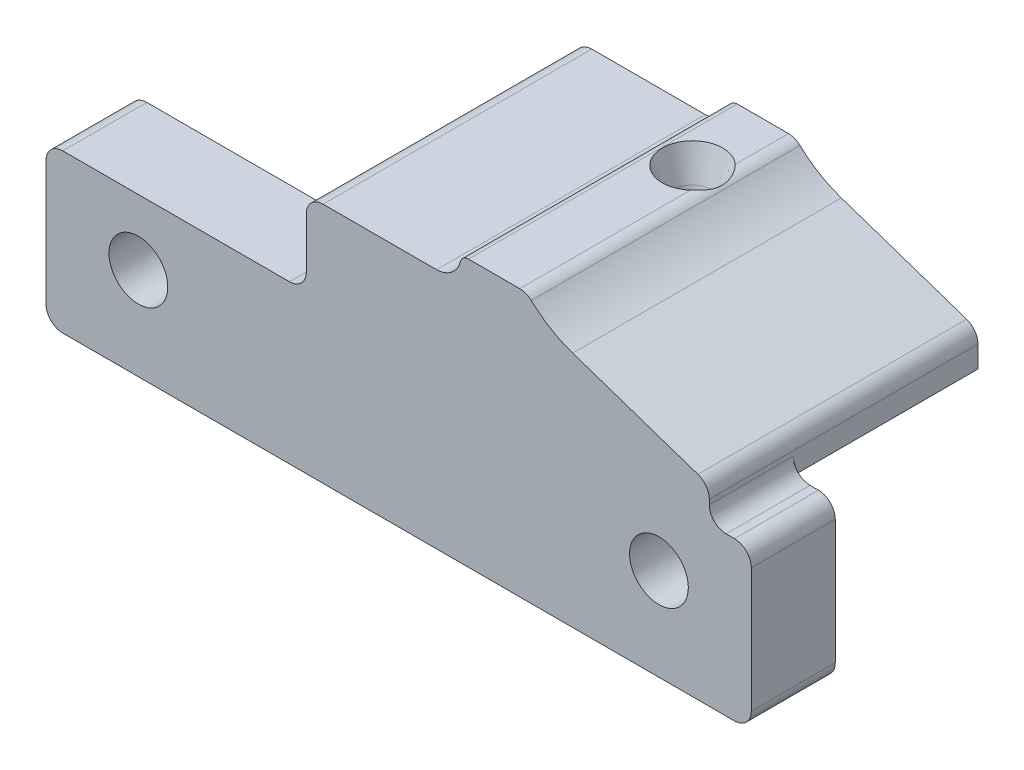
ISO-10303-21;
HEADER;
FILE_DESCRIPTION(('STEP AP214'),'2;1');
FILE_NAME('part.step','',(''),(''),'','','');
FILE_SCHEMA(('AUTOMOTIVE_DESIGN { 1 0 10303 214 1 1 1 1 }'));
ENDSEC;
DATA;
#1=APPLICATION_CONTEXT('core data for automotive mechanical design processes');
#2=APPLICATION_PROTOCOL_DEFINITION('international standard','automotive_design',2000,#1);
#3=PRODUCT_CONTEXT('',#1,'mechanical');
#4=PRODUCT('Part','Part','',(#3));
#5=PRODUCT_RELATED_PRODUCT_CATEGORY('part','',(#4));
#6=PRODUCT_DEFINITION_FORMATION('','',#4);
#7=PRODUCT_DEFINITION_CONTEXT('part definition',#1,'design');
#8=PRODUCT_DEFINITION('design','',#6,#7);
#9=PRODUCT_DEFINITION_SHAPE('','',#8);
#10=(LENGTH_UNIT() NAMED_UNIT(*) SI_UNIT(.MILLI.,.METRE.));
#11=(NAMED_UNIT(*) PLANE_ANGLE_UNIT() SI_UNIT($,.RADIAN.));
#12=(NAMED_UNIT(*) SI_UNIT($,.STERADIAN.) SOLID_ANGLE_UNIT());
#13=UNCERTAINTY_MEASURE_WITH_UNIT(LENGTH_MEASURE(1.E-05),#10,'distance_accuracy_value','');
#14=(GEOMETRIC_REPRESENTATION_CONTEXT(3) GLOBAL_UNCERTAINTY_ASSIGNED_CONTEXT((#13)) GLOBAL_UNIT_ASSIGNED_CONTEXT((#10,
#11,#12)) REPRESENTATION_CONTEXT('',''));
#15=CARTESIAN_POINT('',(0.,0.,0.));
#16=DIRECTION('',(0.,0.,1.));
#17=DIRECTION('',(1.,0.,0.));
#18=AXIS2_PLACEMENT_3D('',#15,#16,#17);
#19=CARTESIAN_POINT('',(40.9999999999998,51.4,5.));
#20=DIRECTION('',(0.,-1.,0.));
#21=DIRECTION('',(0.,0.,-1.));
#22=AXIS2_PLACEMENT_3D('',#19,#20,#21);
#23=PLANE('',#22);
#24=DIRECTION('',(-1.,0.,0.));
#25=VECTOR('',#24,1.);
#26=CARTESIAN_POINT('',(40.9999999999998,51.4,5.));
#27=LINE('',#26,#25);
#28=CARTESIAN_POINT('',(14.4999999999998,51.4,5.));
#29=VERTEX_POINT('',#28);
#30=CARTESIAN_POINT('',(0.99999999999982,51.4,5.));
#31=VERTEX_POINT('',#30);
#32=EDGE_CURVE('E385',#29,#31,#27,.T.);
#33=ORIENTED_EDGE('',*,*,#32,.F.);
#34=DIRECTION('',(0.,0.,-1.));
#35=VECTOR('',#34,1.);
#36=CARTESIAN_POINT('',(14.4999999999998,51.4,5.));
#37=LINE('',#36,#35);
#38=CARTESIAN_POINT('',(14.4999999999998,51.4,0.));
#39=VERTEX_POINT('',#38);
#40=EDGE_CURVE('E387',#29,#39,#37,.T.);
#41=ORIENTED_EDGE('',*,*,#40,.T.);
#42=DIRECTION('',(-1.,0.,0.));
#43=VECTOR('',#42,1.);
#44=CARTESIAN_POINT('',(40.9999999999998,51.4,0.));
#45=LINE('',#44,#43);
#46=CARTESIAN_POINT('',(0.99999999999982,51.4,0.));
#47=VERTEX_POINT('',#46);
#48=EDGE_CURVE('E421',#39,#47,#45,.T.);
#49=ORIENTED_EDGE('',*,*,#48,.T.);
#50=DIRECTION('',(0.,0.,-1.));
#51=VECTOR('',#50,1.);
#52=CARTESIAN_POINT('',(0.99999999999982,51.4,5.));
#53=LINE('',#52,#51);
#54=EDGE_CURVE('E389',#31,#47,#53,.T.);
#55=ORIENTED_EDGE('',*,*,#54,.F.);
#56=EDGE_LOOP('',(#33,#41,#49,#55));
#57=FACE_BOUND('',#56,.T.);
#58=ADVANCED_FACE('F39',(#57),#23,.F.);
#59=CARTESIAN_POINT('',(0.99999999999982,43.,5.));
#60=DIRECTION('',(0.,0.,1.));
#61=DIRECTION('',(1.,0.,0.));
#62=AXIS2_PLACEMENT_3D('',#59,#60,#61);
#63=PLANE('',#62);
#64=CARTESIAN_POINT('',(36.4999999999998,47.5,5.));
#65=DIRECTION('',(0.,0.,1.));
#66=DIRECTION('',(1.,0.,0.));
#67=AXIS2_PLACEMENT_3D('',#64,#65,#66);
#68=CIRCLE('',#67,1.75);
#69=CARTESIAN_POINT('',(38.2499999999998,47.5,5.));
#70=VERTEX_POINT('',#69);
#71=EDGE_CURVE('E501',#70,#70,#68,.T.);
#72=ORIENTED_EDGE('',*,*,#71,.F.);
#73=EDGE_LOOP('',(#72));
#74=FACE_BOUND('',#73,.T.);
#75=DIRECTION('',(-1.,0.,0.));
#76=VECTOR('',#75,1.);
#77=CARTESIAN_POINT('',(15.4999999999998,56.4,5.));
#78=LINE('',#77,#76);
#79=CARTESIAN_POINT('',(23.2567228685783,56.4,5.));
#80=VERTEX_POINT('',#79);
#81=CARTESIAN_POINT('',(16.4999999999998,56.4,5.));
#82=VERTEX_POINT('',#81);
#83=EDGE_CURVE('E481',#80,#82,#78,.T.);
#84=ORIENTED_EDGE('',*,*,#83,.T.);
#85=CARTESIAN_POINT('',(16.4999999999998,55.4,5.));
#86=DIRECTION('',(0.,0.,1.));
#87=DIRECTION('',(1.,0.,0.));
#88=AXIS2_PLACEMENT_3D('',#85,#86,#87);
#89=CIRCLE('',#88,1.);
#90=CARTESIAN_POINT('',(15.4999999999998,55.4,5.));
#91=VERTEX_POINT('',#90);
#92=EDGE_CURVE('E237',#82,#91,#89,.T.);
#93=ORIENTED_EDGE('',*,*,#92,.T.);
#94=DIRECTION('',(0.,-1.,0.));
#95=VECTOR('',#94,1.);
#96=CARTESIAN_POINT('',(15.4999999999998,51.4,5.));
#97=LINE('',#96,#95);
#98=CARTESIAN_POINT('',(15.4999999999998,52.4,5.));
#99=VERTEX_POINT('',#98);
#100=EDGE_CURVE('E483',#91,#99,#97,.T.);
#101=ORIENTED_EDGE('',*,*,#100,.T.);
#102=CARTESIAN_POINT('',(14.4999999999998,52.4,5.));
#103=DIRECTION('',(0.,0.,1.));
#104=DIRECTION('',(1.,0.,0.));
#105=AXIS2_PLACEMENT_3D('',#102,#103,#104);
#106=CIRCLE('',#105,1.);
#107=EDGE_CURVE('E11',#99,#29,#106,.F.);
#108=ORIENTED_EDGE('',*,*,#107,.T.);
#109=ORIENTED_EDGE('',*,*,#32,.T.);
#110=CARTESIAN_POINT('',(0.99999999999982,50.4,5.));
#111=DIRECTION('',(0.,0.,1.));
#112=DIRECTION('',(1.,0.,0.));
#113=AXIS2_PLACEMENT_3D('',#110,#111,#112);
#114=CIRCLE('',#113,1.);
#115=CARTESIAN_POINT('',(-1.80844922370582E-13,50.4,5.));
#116=VERTEX_POINT('',#115);
#117=EDGE_CURVE('E517',#31,#116,#114,.T.);
#118=ORIENTED_EDGE('',*,*,#117,.T.);
#119=DIRECTION('',(0.,-1.,0.));
#120=VECTOR('',#119,1.);
#121=CARTESIAN_POINT('',(-1.80844922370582E-13,50.4,5.));
#122=LINE('',#121,#120);
#123=CARTESIAN_POINT('',(-1.80844922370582E-13,43.,5.));
#124=VERTEX_POINT('',#123);
#125=EDGE_CURVE('E437',#116,#124,#122,.T.);
#126=ORIENTED_EDGE('',*,*,#125,.T.);
#127=CARTESIAN_POINT('',(0.99999999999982,43.,5.));
#128=DIRECTION('',(0.,0.,1.));
#129=DIRECTION('',(1.,0.,0.));
#130=AXIS2_PLACEMENT_3D('',#127,#128,#129);
#131=CIRCLE('',#130,1.);
#132=CARTESIAN_POINT('',(0.999999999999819,42.,5.));
#133=VERTEX_POINT('',#132);
#134=EDGE_CURVE('E432',#124,#133,#131,.T.);
#135=ORIENTED_EDGE('',*,*,#134,.T.);
#136=DIRECTION('',(1.,0.,0.));
#137=VECTOR('',#136,1.);
#138=CARTESIAN_POINT('',(0.999999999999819,42.,5.));
#139=LINE('',#138,#137);
#140=CARTESIAN_POINT('',(40.9999999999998,42.,5.));
#141=VERTEX_POINT('',#140);
#142=EDGE_CURVE('E509',#133,#141,#139,.T.);
#143=ORIENTED_EDGE('',*,*,#142,.T.);
#144=CARTESIAN_POINT('',(40.9999999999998,43.,5.));
#145=DIRECTION('',(0.,0.,1.));
#146=DIRECTION('',(1.,0.,0.));
#147=AXIS2_PLACEMENT_3D('',#144,#145,#146);
#148=CIRCLE('',#147,1.);
#149=CARTESIAN_POINT('',(41.9999999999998,43.,5.));
#150=VERTEX_POINT('',#149);
#151=EDGE_CURVE('E511',#141,#150,#148,.T.);
#152=ORIENTED_EDGE('',*,*,#151,.T.);
#153=DIRECTION('',(0.,1.,0.));
#154=VECTOR('',#153,1.);
#155=CARTESIAN_POINT('',(41.9999999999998,43.,5.));
#156=LINE('',#155,#154);
#157=CARTESIAN_POINT('',(41.9999999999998,50.4,5.));
#158=VERTEX_POINT('',#157);
#159=EDGE_CURVE('E513',#150,#158,#156,.T.);
#160=ORIENTED_EDGE('',*,*,#159,.T.);
#161=CARTESIAN_POINT('',(40.9999999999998,50.4,5.));
#162=DIRECTION('',(0.,0.,1.));
#163=DIRECTION('',(1.,0.,0.));
#164=AXIS2_PLACEMENT_3D('',#161,#162,#163);
#165=CIRCLE('',#164,1.);
#166=CARTESIAN_POINT('',(40.9999999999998,51.4,5.));
#167=VERTEX_POINT('',#166);
#168=EDGE_CURVE('E393',#158,#167,#165,.T.);
#169=ORIENTED_EDGE('',*,*,#168,.T.);
#170=CARTESIAN_POINT('',(40.4999999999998,51.4,5.));
#171=VERTEX_POINT('',#170);
#172=EDGE_CURVE('E392',#167,#171,#27,.T.);
#173=ORIENTED_EDGE('',*,*,#172,.T.);
#174=CARTESIAN_POINT('',(40.4999999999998,52.4,5.));
#175=DIRECTION('',(0.,0.,1.));
#176=DIRECTION('',(1.,0.,0.));
#177=AXIS2_PLACEMENT_3D('',#174,#175,#176);
#178=CIRCLE('',#177,1.);
#179=CARTESIAN_POINT('',(39.4999999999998,52.4,5.));
#180=VERTEX_POINT('',#179);
#181=EDGE_CURVE('E258',#171,#180,#178,.F.);
#182=ORIENTED_EDGE('',*,*,#181,.T.);
#183=DIRECTION('',(0.,1.,0.));
#184=VECTOR('',#183,1.);
#185=CARTESIAN_POINT('',(39.4999999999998,53.4,5.));
#186=LINE('',#185,#184);
#187=CARTESIAN_POINT('',(39.4999999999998,52.6826401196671,5.));
#188=VERTEX_POINT('',#187);
#189=EDGE_CURVE('E472',#180,#188,#186,.T.);
#190=ORIENTED_EDGE('',*,*,#189,.T.);
#191=CARTESIAN_POINT('',(38.4999999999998,52.6826401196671,5.));
#192=DIRECTION('',(0.,0.,1.));
#193=DIRECTION('',(1.,0.,0.));
#194=AXIS2_PLACEMENT_3D('',#191,#192,#193);
#195=CIRCLE('',#194,1.);
#196=CARTESIAN_POINT('',(38.820476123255,53.6298967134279,5.));
#197=VERTEX_POINT('',#196);
#198=EDGE_CURVE('E235',#188,#197,#195,.T.);
#199=ORIENTED_EDGE('',*,*,#198,.T.);
#200=DIRECTION('',(-0.947256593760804,0.320476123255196,0.));
#201=VECTOR('',#200,1.);
#202=CARTESIAN_POINT('',(31.3630042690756,56.1529107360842,5.));
#203=LINE('',#202,#201);
#204=CARTESIAN_POINT('',(31.3630042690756,56.1529107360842,5.));
#205=VERTEX_POINT('',#204);
#206=EDGE_CURVE('E466',#197,#205,#203,.T.);
#207=ORIENTED_EDGE('',*,*,#206,.T.);
#208=CARTESIAN_POINT('',(33.5371519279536,62.5792107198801,5.));
#209=DIRECTION('',(0.,0.,-1.));
#210=DIRECTION('',(1.,0.,0.));
#211=AXIS2_PLACEMENT_3D('',#208,#209,#210);
#212=CIRCLE('',#211,6.78411744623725);
#213=CARTESIAN_POINT('',(28.8975937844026,57.6295895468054,5.));
#214=VERTEX_POINT('',#213);
#215=EDGE_CURVE('E460',#205,#214,#212,.T.);
#216=ORIENTED_EDGE('',*,*,#215,.T.);
#217=CARTESIAN_POINT('',(28.2137084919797,56.9,5.));
#218=DIRECTION('',(0.,0.,1.));
#219=DIRECTION('',(1.,0.,0.));
#220=AXIS2_PLACEMENT_3D('',#217,#218,#219);
#221=CIRCLE('',#220,1.);
#222=CARTESIAN_POINT('',(28.2137084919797,57.9,5.));
#223=VERTEX_POINT('',#222);
#224=EDGE_CURVE('E225',#214,#223,#221,.T.);
#225=ORIENTED_EDGE('',*,*,#224,.T.);
#226=DIRECTION('',(-1.,0.,0.));
#227=VECTOR('',#226,1.);
#228=CARTESIAN_POINT('',(26.1249999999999,57.9,5.));
#229=LINE('',#228,#227);
#230=CARTESIAN_POINT('',(25.1615029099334,57.9,5.));
#231=VERTEX_POINT('',#230);
#232=EDGE_CURVE('E468',#223,#231,#229,.T.);
#233=ORIENTED_EDGE('',*,*,#232,.T.);
#234=CARTESIAN_POINT('',(25.1615029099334,57.4,5.));
#235=DIRECTION('',(0.,0.,1.));
#236=DIRECTION('',(1.,0.,0.));
#237=AXIS2_PLACEMENT_3D('',#234,#235,#236);
#238=CIRCLE('',#237,0.500000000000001);
#239=CARTESIAN_POINT('',(24.6773744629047,57.5249785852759,5.));
#240=VERTEX_POINT('',#239);
#241=EDGE_CURVE('E470',#231,#240,#238,.T.);
#242=ORIENTED_EDGE('',*,*,#241,.T.);
#243=CARTESIAN_POINT('',(23.2246573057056,57.9,5.));
#244=DIRECTION('',(0.,0.,-1.));
#245=DIRECTION('',(-1.,0.,0.));
#246=AXIS2_PLACEMENT_3D('',#243,#244,#245);
#247=CIRCLE('',#246,1.50034269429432);
#248=EDGE_CURVE('E478',#240,#80,#247,.T.);
#249=ORIENTED_EDGE('',*,*,#248,.T.);
#250=EDGE_LOOP('',(#84,#93,#101,#108,#109,#118,#126,#135,#143,#152,#160,#169,#173,#182,#190,
#199,#207,#216,#225,#233,#242,#249));
#251=FACE_BOUND('',#250,.T.);
#252=CARTESIAN_POINT('',(5.49999999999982,47.5,5.));
#253=DIRECTION('',(0.,0.,1.));
#254=DIRECTION('',(1.,0.,0.));
#255=AXIS2_PLACEMENT_3D('',#252,#253,#254);
#256=CIRCLE('',#255,1.75);
#257=CARTESIAN_POINT('',(7.24999999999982,47.5,5.));
#258=VERTEX_POINT('',#257);
#259=EDGE_CURVE('E495',#258,#258,#256,.T.);
#260=ORIENTED_EDGE('',*,*,#259,.F.);
#261=EDGE_LOOP('',(#260));
#262=FACE_BOUND('',#261,.T.);
#263=ADVANCED_FACE('F336',(#74,#251,#262),#63,.T.);
#264=CARTESIAN_POINT('',(0.99999999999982,43.,0.));
#265=DIRECTION('',(0.,0.,1.));
#266=DIRECTION('',(1.,0.,0.));
#267=AXIS2_PLACEMENT_3D('',#264,#265,#266);
#268=PLANE('',#267);
#269=CARTESIAN_POINT('',(0.99999999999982,43.,0.));
#270=DIRECTION('',(0.,0.,1.));
#271=DIRECTION('',(1.,0.,0.));
#272=AXIS2_PLACEMENT_3D('',#269,#270,#271);
#273=CIRCLE('',#272,1.);
#274=CARTESIAN_POINT('',(-1.80844922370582E-13,43.,0.));
#275=VERTEX_POINT('',#274);
#276=CARTESIAN_POINT('',(0.999999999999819,42.,0.));
#277=VERTEX_POINT('',#276);
#278=EDGE_CURVE('E504',#275,#277,#273,.T.);
#279=ORIENTED_EDGE('',*,*,#278,.F.);
#280=DIRECTION('',(0.,-1.,0.));
#281=VECTOR('',#280,1.);
#282=CARTESIAN_POINT('',(-1.80844922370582E-13,50.4,0.));
#283=LINE('',#282,#281);
#284=CARTESIAN_POINT('',(-1.80844922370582E-13,50.4,0.));
#285=VERTEX_POINT('',#284);
#286=EDGE_CURVE('E430',#285,#275,#283,.T.);
#287=ORIENTED_EDGE('',*,*,#286,.F.);
#288=CARTESIAN_POINT('',(0.99999999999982,50.4,0.));
#289=DIRECTION('',(0.,0.,1.));
#290=DIRECTION('',(1.,0.,0.));
#291=AXIS2_PLACEMENT_3D('',#288,#289,#290);
#292=CIRCLE('',#291,1.);
#293=EDGE_CURVE('E424',#47,#285,#292,.T.);
#294=ORIENTED_EDGE('',*,*,#293,.F.);
#295=ORIENTED_EDGE('',*,*,#48,.F.);
#296=CARTESIAN_POINT('',(14.4999999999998,52.4,0.));
#297=DIRECTION('',(0.,0.,1.));
#298=DIRECTION('',(1.,0.,0.));
#299=AXIS2_PLACEMENT_3D('',#296,#297,#298);
#300=CIRCLE('',#299,1.);
#301=CARTESIAN_POINT('',(15.4999999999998,52.4,0.));
#302=VERTEX_POINT('',#301);
#303=EDGE_CURVE('E47',#39,#302,#300,.T.);
#304=ORIENTED_EDGE('',*,*,#303,.T.);
#305=DIRECTION('',(0.,1.,0.));
#306=VECTOR('',#305,1.);
#307=CARTESIAN_POINT('',(15.4999999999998,51.4,0.));
#308=LINE('',#307,#306);
#309=CARTESIAN_POINT('',(15.4999999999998,51.4,0.));
#310=VERTEX_POINT('',#309);
#311=EDGE_CURVE('E54',#310,#302,#308,.T.);
#312=ORIENTED_EDGE('',*,*,#311,.F.);
#313=CARTESIAN_POINT('',(39.4999999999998,51.4,0.));
#314=VERTEX_POINT('',#313);
#315=EDGE_CURVE('E418',#314,#310,#45,.T.);
#316=ORIENTED_EDGE('',*,*,#315,.F.);
#317=DIRECTION('',(0.,-1.,0.));
#318=VECTOR('',#317,1.);
#319=CARTESIAN_POINT('',(39.4999999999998,53.4,0.));
#320=LINE('',#319,#318);
#321=CARTESIAN_POINT('',(39.4999999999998,52.4,0.));
#322=VERTEX_POINT('',#321);
#323=EDGE_CURVE('E245',#322,#314,#320,.T.);
#324=ORIENTED_EDGE('',*,*,#323,.F.);
#325=CARTESIAN_POINT('',(40.4999999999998,52.4,0.));
#326=DIRECTION('',(0.,0.,1.));
#327=DIRECTION('',(1.,0.,0.));
#328=AXIS2_PLACEMENT_3D('',#325,#326,#327);
#329=CIRCLE('',#328,1.);
#330=CARTESIAN_POINT('',(40.4999999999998,51.4,0.));
#331=VERTEX_POINT('',#330);
#332=EDGE_CURVE('E211',#322,#331,#329,.T.);
#333=ORIENTED_EDGE('',*,*,#332,.T.);
#334=CARTESIAN_POINT('',(40.9999999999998,51.4,0.));
#335=VERTEX_POINT('',#334);
#336=EDGE_CURVE('E420',#335,#331,#45,.T.);
#337=ORIENTED_EDGE('',*,*,#336,.F.);
#338=CARTESIAN_POINT('',(40.9999999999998,50.4,0.));
#339=DIRECTION('',(0.,0.,1.));
#340=DIRECTION('',(1.,0.,0.));
#341=AXIS2_PLACEMENT_3D('',#338,#339,#340);
#342=CIRCLE('',#341,1.);
#343=CARTESIAN_POINT('',(41.9999999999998,50.4,0.));
#344=VERTEX_POINT('',#343);
#345=EDGE_CURVE('E425',#344,#335,#342,.T.);
#346=ORIENTED_EDGE('',*,*,#345,.F.);
#347=DIRECTION('',(0.,1.,0.));
#348=VECTOR('',#347,1.);
#349=CARTESIAN_POINT('',(41.9999999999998,43.,0.));
#350=LINE('',#349,#348);
#351=CARTESIAN_POINT('',(41.9999999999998,43.,0.));
#352=VERTEX_POINT('',#351);
#353=EDGE_CURVE('E524',#352,#344,#350,.T.);
#354=ORIENTED_EDGE('',*,*,#353,.F.);
#355=CARTESIAN_POINT('',(40.9999999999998,43.,0.));
#356=DIRECTION('',(0.,0.,1.));
#357=DIRECTION('',(1.,0.,0.));
#358=AXIS2_PLACEMENT_3D('',#355,#356,#357);
#359=CIRCLE('',#358,1.);
#360=CARTESIAN_POINT('',(40.9999999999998,42.,0.));
#361=VERTEX_POINT('',#360);
#362=EDGE_CURVE('E523',#361,#352,#359,.T.);
#363=ORIENTED_EDGE('',*,*,#362,.F.);
#364=DIRECTION('',(1.,0.,0.));
#365=VECTOR('',#364,1.);
#366=CARTESIAN_POINT('',(0.999999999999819,42.,0.));
#367=LINE('',#366,#365);
#368=EDGE_CURVE('E521',#277,#361,#367,.T.);
#369=ORIENTED_EDGE('',*,*,#368,.F.);
#370=EDGE_LOOP('',(#279,#287,#294,#295,#304,#312,#316,#324,#333,#337,#346,#354,#363,#369));
#371=FACE_BOUND('',#370,.T.);
#372=CARTESIAN_POINT('',(36.4999999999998,47.5,0.));
#373=DIRECTION('',(0.,0.,1.));
#374=DIRECTION('',(1.,0.,0.));
#375=AXIS2_PLACEMENT_3D('',#372,#373,#374);
#376=CIRCLE('',#375,1.75);
#377=CARTESIAN_POINT('',(38.2499999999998,47.5,0.));
#378=VERTEX_POINT('',#377);
#379=EDGE_CURVE('E498',#378,#378,#376,.T.);
#380=ORIENTED_EDGE('',*,*,#379,.T.);
#381=EDGE_LOOP('',(#380));
#382=FACE_BOUND('',#381,.T.);
#383=CARTESIAN_POINT('',(5.49999999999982,47.5,0.));
#384=DIRECTION('',(0.,0.,1.));
#385=DIRECTION('',(1.,0.,0.));
#386=AXIS2_PLACEMENT_3D('',#383,#384,#385);
#387=CIRCLE('',#386,1.75);
#388=CARTESIAN_POINT('',(7.24999999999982,47.5,0.));
#389=VERTEX_POINT('',#388);
#390=EDGE_CURVE('E414',#389,#389,#387,.T.);
#391=ORIENTED_EDGE('',*,*,#390,.T.);
#392=EDGE_LOOP('',(#391));
#393=FACE_BOUND('',#392,.T.);
#394=ADVANCED_FACE('F339',(#371,#382,#393),#268,.F.);
#395=CARTESIAN_POINT('',(0.99999999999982,43.,5.));
#396=DIRECTION('',(0.,0.,-1.));
#397=DIRECTION('',(-1.,0.,0.));
#398=AXIS2_PLACEMENT_3D('',#395,#396,#397);
#399=CYLINDRICAL_SURFACE('',#398,1.);
#400=ORIENTED_EDGE('',*,*,#278,.T.);
#401=DIRECTION('',(0.,0.,-1.));
#402=VECTOR('',#401,1.);
#403=CARTESIAN_POINT('',(0.999999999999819,42.,5.));
#404=LINE('',#403,#402);
#405=EDGE_CURVE('E453',#133,#277,#404,.T.);
#406=ORIENTED_EDGE('',*,*,#405,.F.);
#407=ORIENTED_EDGE('',*,*,#134,.F.);
#408=DIRECTION('',(0.,0.,-1.));
#409=VECTOR('',#408,1.);
#410=CARTESIAN_POINT('',(-1.80844922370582E-13,43.,5.));
#411=LINE('',#410,#409);
#412=EDGE_CURVE('E433',#124,#275,#411,.T.);
#413=ORIENTED_EDGE('',*,*,#412,.T.);
#414=EDGE_LOOP('',(#400,#406,#407,#413));
#415=FACE_BOUND('',#414,.T.);
#416=ADVANCED_FACE('F343',(#415),#399,.T.);
#417=CARTESIAN_POINT('',(0.999999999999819,42.,5.));
#418=DIRECTION('',(0.,1.,0.));
#419=DIRECTION('',(0.,0.,1.));
#420=AXIS2_PLACEMENT_3D('',#417,#418,#419);
#421=PLANE('',#420);
#422=ORIENTED_EDGE('',*,*,#368,.T.);
#423=DIRECTION('',(0.,0.,-1.));
#424=VECTOR('',#423,1.);
#425=CARTESIAN_POINT('',(40.9999999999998,42.,5.));
#426=LINE('',#425,#424);
#427=EDGE_CURVE('E450',#141,#361,#426,.T.);
#428=ORIENTED_EDGE('',*,*,#427,.F.);
#429=ORIENTED_EDGE('',*,*,#142,.F.);
#430=ORIENTED_EDGE('',*,*,#405,.T.);
#431=EDGE_LOOP('',(#422,#428,#429,#430));
#432=FACE_BOUND('',#431,.T.);
#433=ADVANCED_FACE('F366',(#432),#421,.F.);
#434=CARTESIAN_POINT('',(40.9999999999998,43.,5.));
#435=DIRECTION('',(0.,0.,-1.));
#436=DIRECTION('',(-1.,0.,0.));
#437=AXIS2_PLACEMENT_3D('',#434,#435,#436);
#438=CYLINDRICAL_SURFACE('',#437,1.);
#439=ORIENTED_EDGE('',*,*,#362,.T.);
#440=DIRECTION('',(0.,0.,-1.));
#441=VECTOR('',#440,1.);
#442=CARTESIAN_POINT('',(41.9999999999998,43.,5.));
#443=LINE('',#442,#441);
#444=EDGE_CURVE('E447',#150,#352,#443,.T.);
#445=ORIENTED_EDGE('',*,*,#444,.F.);
#446=ORIENTED_EDGE('',*,*,#151,.F.);
#447=ORIENTED_EDGE('',*,*,#427,.T.);
#448=EDGE_LOOP('',(#439,#445,#446,#447));
#449=FACE_BOUND('',#448,.T.);
#450=ADVANCED_FACE('F362',(#449),#438,.T.);
#451=CARTESIAN_POINT('',(41.9999999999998,43.,5.));
#452=DIRECTION('',(-1.,0.,0.));
#453=DIRECTION('',(0.,0.,1.));
#454=AXIS2_PLACEMENT_3D('',#451,#452,#453);
#455=PLANE('',#454);
#456=ORIENTED_EDGE('',*,*,#353,.T.);
#457=DIRECTION('',(0.,0.,-1.));
#458=VECTOR('',#457,1.);
#459=CARTESIAN_POINT('',(41.9999999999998,50.4,5.));
#460=LINE('',#459,#458);
#461=EDGE_CURVE('E444',#158,#344,#460,.T.);
#462=ORIENTED_EDGE('',*,*,#461,.F.);
#463=ORIENTED_EDGE('',*,*,#159,.F.);
#464=ORIENTED_EDGE('',*,*,#444,.T.);
#465=EDGE_LOOP('',(#456,#462,#463,#464));
#466=FACE_BOUND('',#465,.T.);
#467=ADVANCED_FACE('F358',(#466),#455,.F.);
#468=CARTESIAN_POINT('',(40.9999999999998,50.4,5.));
#469=DIRECTION('',(0.,0.,-1.));
#470=DIRECTION('',(-1.,0.,0.));
#471=AXIS2_PLACEMENT_3D('',#468,#469,#470);
#472=CYLINDRICAL_SURFACE('',#471,1.);
#473=ORIENTED_EDGE('',*,*,#345,.T.);
#474=DIRECTION('',(0.,0.,-1.));
#475=VECTOR('',#474,1.);
#476=CARTESIAN_POINT('',(40.9999999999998,51.4,5.));
#477=LINE('',#476,#475);
#478=EDGE_CURVE('E441',#167,#335,#477,.T.);
#479=ORIENTED_EDGE('',*,*,#478,.F.);
#480=ORIENTED_EDGE('',*,*,#168,.F.);
#481=ORIENTED_EDGE('',*,*,#461,.T.);
#482=EDGE_LOOP('',(#473,#479,#480,#481));
#483=FACE_BOUND('',#482,.T.);
#484=ADVANCED_FACE('F354',(#483),#472,.T.);
#485=ORIENTED_EDGE('',*,*,#336,.T.);
#486=DIRECTION('',(0.,0.,1.));
#487=VECTOR('',#486,1.);
#488=CARTESIAN_POINT('',(40.4999999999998,51.4,5.));
#489=LINE('',#488,#487);
#490=EDGE_CURVE('E255',#331,#171,#489,.T.);
#491=ORIENTED_EDGE('',*,*,#490,.T.);
#492=ORIENTED_EDGE('',*,*,#172,.F.);
#493=ORIENTED_EDGE('',*,*,#478,.T.);
#494=EDGE_LOOP('',(#485,#491,#492,#493));
#495=FACE_BOUND('',#494,.T.);
#496=ADVANCED_FACE('F350',(#495),#23,.F.);
#497=CARTESIAN_POINT('',(0.99999999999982,50.4,5.));
#498=DIRECTION('',(0.,0.,-1.));
#499=DIRECTION('',(-1.,0.,0.));
#500=AXIS2_PLACEMENT_3D('',#497,#498,#499);
#501=CYLINDRICAL_SURFACE('',#500,1.);
#502=ORIENTED_EDGE('',*,*,#293,.T.);
#503=DIRECTION('',(0.,0.,-1.));
#504=VECTOR('',#503,1.);
#505=CARTESIAN_POINT('',(-1.80844922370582E-13,50.4,5.));
#506=LINE('',#505,#504);
#507=EDGE_CURVE('E436',#116,#285,#506,.T.);
#508=ORIENTED_EDGE('',*,*,#507,.F.);
#509=ORIENTED_EDGE('',*,*,#117,.F.);
#510=ORIENTED_EDGE('',*,*,#54,.T.);
#511=EDGE_LOOP('',(#502,#508,#509,#510));
#512=FACE_BOUND('',#511,.T.);
#513=ADVANCED_FACE('F346',(#512),#501,.T.);
#514=CARTESIAN_POINT('',(-1.80844922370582E-13,50.4,5.));
#515=DIRECTION('',(1.,0.,0.));
#516=DIRECTION('',(0.,0.,-1.));
#517=AXIS2_PLACEMENT_3D('',#514,#515,#516);
#518=PLANE('',#517);
#519=ORIENTED_EDGE('',*,*,#286,.T.);
#520=ORIENTED_EDGE('',*,*,#412,.F.);
#521=ORIENTED_EDGE('',*,*,#125,.F.);
#522=ORIENTED_EDGE('',*,*,#507,.T.);
#523=EDGE_LOOP('',(#519,#520,#521,#522));
#524=FACE_BOUND('',#523,.T.);
#525=ADVANCED_FACE('F334',(#524),#518,.F.);
#526=CARTESIAN_POINT('',(36.4999999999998,47.5,5.));
#527=DIRECTION('',(0.,0.,-1.));
#528=DIRECTION('',(-1.,0.,0.));
#529=AXIS2_PLACEMENT_3D('',#526,#527,#528);
#530=CYLINDRICAL_SURFACE('',#529,1.75);
#531=ORIENTED_EDGE('',*,*,#71,.T.);
#532=EDGE_LOOP('',(#531));
#533=FACE_BOUND('',#532,.T.);
#534=ORIENTED_EDGE('',*,*,#379,.F.);
#535=EDGE_LOOP('',(#534));
#536=FACE_BOUND('',#535,.T.);
#537=ADVANCED_FACE('F330',(#533,#536),#530,.F.);
#538=CARTESIAN_POINT('',(5.49999999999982,47.5,5.));
#539=DIRECTION('',(0.,0.,-1.));
#540=DIRECTION('',(-1.,0.,0.));
#541=AXIS2_PLACEMENT_3D('',#538,#539,#540);
#542=CYLINDRICAL_SURFACE('',#541,1.75);
#543=ORIENTED_EDGE('',*,*,#259,.T.);
#544=EDGE_LOOP('',(#543));
#545=FACE_BOUND('',#544,.T.);
#546=ORIENTED_EDGE('',*,*,#390,.F.);
#547=EDGE_LOOP('',(#546));
#548=FACE_BOUND('',#547,.T.);
#549=ADVANCED_FACE('F326',(#545,#548),#542,.F.);
#550=CARTESIAN_POINT('',(39.4999999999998,51.4,-11.));
#551=DIRECTION('',(0.,-1.,0.));
#552=DIRECTION('',(0.,0.,-1.));
#553=AXIS2_PLACEMENT_3D('',#550,#551,#552);
#554=PLANE('',#553);
#555=CARTESIAN_POINT('',(26.9999999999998,51.4,-6.5));
#556=DIRECTION('',(0.,-1.,0.));
#557=DIRECTION('',(0.,0.,-1.));
#558=AXIS2_PLACEMENT_3D('',#555,#556,#557);
#559=CIRCLE('',#558,2.1585);
#560=CARTESIAN_POINT('',(26.9999999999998,51.4,-8.65849999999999));
#561=VERTEX_POINT('',#560);
#562=EDGE_CURVE('E219',#561,#561,#559,.T.);
#563=ORIENTED_EDGE('',*,*,#562,.F.);
#564=EDGE_LOOP('',(#563));
#565=FACE_BOUND('',#564,.T.);
#566=ORIENTED_EDGE('',*,*,#315,.T.);
#567=DIRECTION('',(0.,0.,1.));
#568=VECTOR('',#567,1.);
#569=CARTESIAN_POINT('',(15.4999999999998,51.4,-11.));
#570=LINE('',#569,#568);
#571=CARTESIAN_POINT('',(15.4999999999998,51.4,-11.));
#572=VERTEX_POINT('',#571);
#573=EDGE_CURVE('E407',#572,#310,#570,.T.);
#574=ORIENTED_EDGE('',*,*,#573,.F.);
#575=DIRECTION('',(1.,0.,0.));
#576=VECTOR('',#575,1.);
#577=CARTESIAN_POINT('',(39.4999999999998,51.4,-11.));
#578=LINE('',#577,#576);
#579=CARTESIAN_POINT('',(39.4999999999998,51.4,-11.));
#580=VERTEX_POINT('',#579);
#581=EDGE_CURVE('E484',#572,#580,#578,.T.);
#582=ORIENTED_EDGE('',*,*,#581,.T.);
#583=DIRECTION('',(0.,0.,1.));
#584=VECTOR('',#583,1.);
#585=CARTESIAN_POINT('',(39.4999999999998,51.4,-11.));
#586=LINE('',#585,#584);
#587=EDGE_CURVE('E419',#580,#314,#586,.T.);
#588=ORIENTED_EDGE('',*,*,#587,.T.);
#589=EDGE_LOOP('',(#566,#574,#582,#588));
#590=FACE_BOUND('',#589,.T.);
#591=ADVANCED_FACE('F298',(#565,#590),#554,.T.);
#592=CARTESIAN_POINT('',(15.4999999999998,51.4,-11.));
#593=DIRECTION('',(-1.,0.,0.));
#594=DIRECTION('',(0.,0.,1.));
#595=AXIS2_PLACEMENT_3D('',#592,#593,#594);
#596=PLANE('',#595);
#597=ORIENTED_EDGE('',*,*,#573,.T.);
#598=ORIENTED_EDGE('',*,*,#311,.T.);
#599=DIRECTION('',(0.,0.,-1.));
#600=VECTOR('',#599,1.);
#601=CARTESIAN_POINT('',(15.4999999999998,52.4,-11.));
#602=LINE('',#601,#600);
#603=EDGE_CURVE('E398',#302,#99,#602,.F.);
#604=ORIENTED_EDGE('',*,*,#603,.T.);
#605=ORIENTED_EDGE('',*,*,#100,.F.);
#606=DIRECTION('',(0.,0.,1.));
#607=VECTOR('',#606,1.);
#608=CARTESIAN_POINT('',(15.4999999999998,55.4,-11.));
#609=LINE('',#608,#607);
#610=CARTESIAN_POINT('',(15.4999999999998,55.4,-11.));
#611=VERTEX_POINT('',#610);
#612=EDGE_CURVE('E239',#91,#611,#609,.F.);
#613=ORIENTED_EDGE('',*,*,#612,.T.);
#614=DIRECTION('',(0.,-1.,0.));
#615=VECTOR('',#614,1.);
#616=CARTESIAN_POINT('',(15.4999999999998,51.4,-11.));
#617=LINE('',#616,#615);
#618=EDGE_CURVE('E410',#611,#572,#617,.T.);
#619=ORIENTED_EDGE('',*,*,#618,.T.);
#620=EDGE_LOOP('',(#597,#598,#604,#605,#613,#619));
#621=FACE_BOUND('',#620,.T.);
#622=ADVANCED_FACE('F294',(#621),#596,.T.);
#623=CARTESIAN_POINT('',(15.4999999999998,56.4,-11.));
#624=DIRECTION('',(0.,1.,0.));
#625=DIRECTION('',(0.,0.,1.));
#626=AXIS2_PLACEMENT_3D('',#623,#624,#625);
#627=PLANE('',#626);
#628=DIRECTION('',(-1.,0.,0.));
#629=VECTOR('',#628,1.);
#630=CARTESIAN_POINT('',(15.4999999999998,56.4,-11.));
#631=LINE('',#630,#629);
#632=CARTESIAN_POINT('',(23.2567228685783,56.4,-11.));
#633=VERTEX_POINT('',#632);
#634=CARTESIAN_POINT('',(16.4999999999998,56.4,-11.));
#635=VERTEX_POINT('',#634);
#636=EDGE_CURVE('E560',#633,#635,#631,.T.);
#637=ORIENTED_EDGE('',*,*,#636,.T.);
#638=DIRECTION('',(0.,0.,1.));
#639=VECTOR('',#638,1.);
#640=CARTESIAN_POINT('',(16.4999999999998,56.4,-11.));
#641=LINE('',#640,#639);
#642=EDGE_CURVE('E232',#635,#82,#641,.T.);
#643=ORIENTED_EDGE('',*,*,#642,.T.);
#644=ORIENTED_EDGE('',*,*,#83,.F.);
#645=DIRECTION('',(0.,0.,1.));
#646=VECTOR('',#645,1.);
#647=CARTESIAN_POINT('',(23.2567228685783,56.4,-11.));
#648=LINE('',#647,#646);
#649=EDGE_CURVE('E415',#633,#80,#648,.T.);
#650=ORIENTED_EDGE('',*,*,#649,.F.);
#651=EDGE_LOOP('',(#637,#643,#644,#650));
#652=FACE_BOUND('',#651,.T.);
#653=ADVANCED_FACE('F297',(#652),#627,.T.);
#654=CARTESIAN_POINT('',(23.2246573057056,57.9,-11.));
#655=DIRECTION('',(0.,0.,1.));
#656=DIRECTION('',(1.,0.,0.));
#657=AXIS2_PLACEMENT_3D('',#654,#655,#656);
#658=CYLINDRICAL_SURFACE('',#657,1.50034269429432);
#659=ORIENTED_EDGE('',*,*,#248,.F.);
#660=DIRECTION('',(0.,0.,1.));
#661=VECTOR('',#660,1.);
#662=CARTESIAN_POINT('',(24.6773744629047,57.5249785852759,-11.));
#663=LINE('',#662,#661);
#664=CARTESIAN_POINT('',(24.6773744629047,57.5249785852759,-11.));
#665=VERTEX_POINT('',#664);
#666=EDGE_CURVE('E487',#665,#240,#663,.T.);
#667=ORIENTED_EDGE('',*,*,#666,.F.);
#668=CARTESIAN_POINT('',(23.2246573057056,57.9,-11.));
#669=DIRECTION('',(0.,0.,-1.));
#670=DIRECTION('',(-1.,0.,0.));
#671=AXIS2_PLACEMENT_3D('',#668,#669,#670);
#672=CIRCLE('',#671,1.50034269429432);
#673=EDGE_CURVE('E563',#665,#633,#672,.T.);
#674=ORIENTED_EDGE('',*,*,#673,.T.);
#675=ORIENTED_EDGE('',*,*,#649,.T.);
#676=EDGE_LOOP('',(#659,#667,#674,#675));
#677=FACE_BOUND('',#676,.T.);
#678=ADVANCED_FACE('F302',(#677),#658,.F.);
#679=CARTESIAN_POINT('',(25.1615029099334,57.4,-11.));
#680=DIRECTION('',(0.,0.,1.));
#681=DIRECTION('',(1.,0.,0.));
#682=AXIS2_PLACEMENT_3D('',#679,#680,#681);
#683=CYLINDRICAL_SURFACE('',#682,0.500000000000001);
#684=ORIENTED_EDGE('',*,*,#241,.F.);
#685=DIRECTION('',(0.,0.,1.));
#686=VECTOR('',#685,1.);
#687=CARTESIAN_POINT('',(25.1615029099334,57.9,-11.));
#688=LINE('',#687,#686);
#689=CARTESIAN_POINT('',(25.1615029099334,57.9,-11.));
#690=VERTEX_POINT('',#689);
#691=EDGE_CURVE('E489',#690,#231,#688,.T.);
#692=ORIENTED_EDGE('',*,*,#691,.F.);
#693=CARTESIAN_POINT('',(25.1615029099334,57.4,-11.));
#694=DIRECTION('',(0.,0.,1.));
#695=DIRECTION('',(1.,0.,0.));
#696=AXIS2_PLACEMENT_3D('',#693,#694,#695);
#697=CIRCLE('',#696,0.500000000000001);
#698=EDGE_CURVE('E566',#690,#665,#697,.T.);
#699=ORIENTED_EDGE('',*,*,#698,.T.);
#700=ORIENTED_EDGE('',*,*,#666,.T.);
#701=EDGE_LOOP('',(#684,#692,#699,#700));
#702=FACE_BOUND('',#701,.T.);
#703=ADVANCED_FACE('F306',(#702),#683,.T.);
#704=CARTESIAN_POINT('',(26.1249999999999,57.9,-11.));
#705=DIRECTION('',(0.,1.,0.));
#706=DIRECTION('',(0.,0.,1.));
#707=AXIS2_PLACEMENT_3D('',#704,#705,#706);
#708=PLANE('',#707);
#709=CARTESIAN_POINT('',(26.9999999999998,57.9,-6.49999999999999));
#710=DIRECTION('',(0.,1.,0.));
#711=DIRECTION('',(0.,0.,1.));
#712=AXIS2_PLACEMENT_3D('',#709,#710,#711);
#713=CIRCLE('',#712,1.8);
#714=CARTESIAN_POINT('',(28.2137084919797,57.9,-7.82925230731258));
#715=VERTEX_POINT('',#714);
#716=CARTESIAN_POINT('',(28.2137084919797,57.9,-5.17074769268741));
#717=VERTEX_POINT('',#716);
#718=EDGE_CURVE('E205',#715,#717,#713,.T.);
#719=ORIENTED_EDGE('',*,*,#718,.F.);
#720=DIRECTION('',(0.,0.,1.));
#721=VECTOR('',#720,1.);
#722=CARTESIAN_POINT('',(28.2137084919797,57.9,-11.));
#723=LINE('',#722,#721);
#724=CARTESIAN_POINT('',(28.2137084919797,57.9,-11.));
#725=VERTEX_POINT('',#724);
#726=EDGE_CURVE('E215',#715,#725,#723,.F.);
#727=ORIENTED_EDGE('',*,*,#726,.T.);
#728=DIRECTION('',(-1.,0.,0.));
#729=VECTOR('',#728,1.);
#730=CARTESIAN_POINT('',(26.1249999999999,57.9,-11.));
#731=LINE('',#730,#729);
#732=EDGE_CURVE('E569',#725,#690,#731,.T.);
#733=ORIENTED_EDGE('',*,*,#732,.T.);
#734=ORIENTED_EDGE('',*,*,#691,.T.);
#735=ORIENTED_EDGE('',*,*,#232,.F.);
#736=EDGE_CURVE('E218',#223,#717,#723,.F.);
#737=ORIENTED_EDGE('',*,*,#736,.T.);
#738=EDGE_LOOP('',(#719,#727,#733,#734,#735,#737));
#739=FACE_BOUND('',#738,.T.);
#740=ADVANCED_FACE('F214',(#739),#708,.T.);
#741=CARTESIAN_POINT('',(33.5371519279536,62.5792107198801,-11.));
#742=DIRECTION('',(0.,0.,1.));
#743=DIRECTION('',(1.,0.,0.));
#744=AXIS2_PLACEMENT_3D('',#741,#742,#743);
#745=CYLINDRICAL_SURFACE('',#744,6.78411744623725);
#746=CARTESIAN_POINT('',(33.5371519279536,62.5792107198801,-11.));
#747=DIRECTION('',(0.,0.,-1.));
#748=DIRECTION('',(1.,0.,0.));
#749=AXIS2_PLACEMENT_3D('',#746,#747,#748);
#750=CIRCLE('',#749,6.78411744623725);
#751=CARTESIAN_POINT('',(31.3630042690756,56.1529107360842,-11.));
#752=VERTEX_POINT('',#751);
#753=CARTESIAN_POINT('',(28.8975937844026,57.6295895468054,-11.));
#754=VERTEX_POINT('',#753);
#755=EDGE_CURVE('E462',#752,#754,#750,.T.);
#756=ORIENTED_EDGE('',*,*,#755,.T.);
#757=DIRECTION('',(0.,0.,1.));
#758=VECTOR('',#757,1.);
#759=CARTESIAN_POINT('',(28.8975937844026,57.6295895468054,-11.));
#760=LINE('',#759,#758);
#761=EDGE_CURVE('E227',#754,#214,#760,.T.);
#762=ORIENTED_EDGE('',*,*,#761,.T.);
#763=ORIENTED_EDGE('',*,*,#215,.F.);
#764=DIRECTION('',(0.,0.,1.));
#765=VECTOR('',#764,1.);
#766=CARTESIAN_POINT('',(31.3630042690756,56.1529107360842,-11.));
#767=LINE('',#766,#765);
#768=EDGE_CURVE('E492',#752,#205,#767,.T.);
#769=ORIENTED_EDGE('',*,*,#768,.F.);
#770=EDGE_LOOP('',(#756,#762,#763,#769));
#771=FACE_BOUND('',#770,.T.);
#772=ADVANCED_FACE('F313',(#771),#745,.F.);
#773=CARTESIAN_POINT('',(31.3630042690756,56.1529107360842,-11.));
#774=DIRECTION('',(0.320476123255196,0.947256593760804,0.));
#775=DIRECTION('',(-0.947256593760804,0.320476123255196,0.));
#776=AXIS2_PLACEMENT_3D('',#773,#774,#775);
#777=PLANE('',#776);
#778=ORIENTED_EDGE('',*,*,#206,.F.);
#779=DIRECTION('',(0.,0.,1.));
#780=VECTOR('',#779,1.);
#781=CARTESIAN_POINT('',(38.820476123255,53.6298967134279,-11.));
#782=LINE('',#781,#780);
#783=CARTESIAN_POINT('',(38.820476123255,53.6298967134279,-11.));
#784=VERTEX_POINT('',#783);
#785=EDGE_CURVE('E253',#197,#784,#782,.F.);
#786=ORIENTED_EDGE('',*,*,#785,.T.);
#787=DIRECTION('',(-0.947256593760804,0.320476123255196,0.));
#788=VECTOR('',#787,1.);
#789=CARTESIAN_POINT('',(31.3630042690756,56.1529107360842,-11.));
#790=LINE('',#789,#788);
#791=EDGE_CURVE('E572',#784,#752,#790,.T.);
#792=ORIENTED_EDGE('',*,*,#791,.T.);
#793=ORIENTED_EDGE('',*,*,#768,.T.);
#794=EDGE_LOOP('',(#778,#786,#792,#793));
#795=FACE_BOUND('',#794,.T.);
#796=ADVANCED_FACE('F316',(#795),#777,.T.);
#797=CARTESIAN_POINT('',(39.4999999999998,53.4,-11.));
#798=DIRECTION('',(1.,0.,0.));
#799=DIRECTION('',(0.,0.,-1.));
#800=AXIS2_PLACEMENT_3D('',#797,#798,#799);
#801=PLANE('',#800);
#802=DIRECTION('',(0.,1.,0.));
#803=VECTOR('',#802,1.);
#804=CARTESIAN_POINT('',(39.4999999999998,53.4,-11.));
#805=LINE('',#804,#803);
#806=CARTESIAN_POINT('',(39.4999999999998,52.6826401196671,-11.));
#807=VERTEX_POINT('',#806);
#808=EDGE_CURVE('E574',#580,#807,#805,.T.);
#809=ORIENTED_EDGE('',*,*,#808,.T.);
#810=DIRECTION('',(0.,0.,1.));
#811=VECTOR('',#810,1.);
#812=CARTESIAN_POINT('',(39.4999999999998,52.6826401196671,-11.));
#813=LINE('',#812,#811);
#814=EDGE_CURVE('E250',#807,#188,#813,.T.);
#815=ORIENTED_EDGE('',*,*,#814,.T.);
#816=ORIENTED_EDGE('',*,*,#189,.F.);
#817=DIRECTION('',(0.,0.,1.));
#818=VECTOR('',#817,1.);
#819=CARTESIAN_POINT('',(39.4999999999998,52.4,-11.));
#820=LINE('',#819,#818);
#821=EDGE_CURVE('E247',#180,#322,#820,.F.);
#822=ORIENTED_EDGE('',*,*,#821,.T.);
#823=ORIENTED_EDGE('',*,*,#323,.T.);
#824=ORIENTED_EDGE('',*,*,#587,.F.);
#825=EDGE_LOOP('',(#809,#815,#816,#822,#823,#824));
#826=FACE_BOUND('',#825,.T.);
#827=ADVANCED_FACE('F292',(#826),#801,.T.);
#828=CARTESIAN_POINT('',(23.2246573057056,57.9,-11.));
#829=DIRECTION('',(0.,0.,-1.));
#830=DIRECTION('',(-1.,0.,0.));
#831=AXIS2_PLACEMENT_3D('',#828,#829,#830);
#832=PLANE('',#831);
#833=ORIENTED_EDGE('',*,*,#618,.F.);
#834=CARTESIAN_POINT('',(16.4999999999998,55.4,-11.));
#835=DIRECTION('',(0.,0.,-1.));
#836=DIRECTION('',(-1.,0.,0.));
#837=AXIS2_PLACEMENT_3D('',#834,#835,#836);
#838=CIRCLE('',#837,1.);
#839=EDGE_CURVE('E243',#611,#635,#838,.T.);
#840=ORIENTED_EDGE('',*,*,#839,.T.);
#841=ORIENTED_EDGE('',*,*,#636,.F.);
#842=ORIENTED_EDGE('',*,*,#673,.F.);
#843=ORIENTED_EDGE('',*,*,#698,.F.);
#844=ORIENTED_EDGE('',*,*,#732,.F.);
#845=CARTESIAN_POINT('',(28.2137084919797,56.9,-11.));
#846=DIRECTION('',(0.,0.,-1.));
#847=DIRECTION('',(-1.,0.,0.));
#848=AXIS2_PLACEMENT_3D('',#845,#846,#847);
#849=CIRCLE('',#848,1.);
#850=EDGE_CURVE('E224',#725,#754,#849,.T.);
#851=ORIENTED_EDGE('',*,*,#850,.T.);
#852=ORIENTED_EDGE('',*,*,#755,.F.);
#853=ORIENTED_EDGE('',*,*,#791,.F.);
#854=CARTESIAN_POINT('',(38.4999999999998,52.6826401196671,-11.));
#855=DIRECTION('',(0.,0.,-1.));
#856=DIRECTION('',(-1.,0.,0.));
#857=AXIS2_PLACEMENT_3D('',#854,#855,#856);
#858=CIRCLE('',#857,1.);
#859=EDGE_CURVE('E241',#784,#807,#858,.T.);
#860=ORIENTED_EDGE('',*,*,#859,.T.);
#861=ORIENTED_EDGE('',*,*,#808,.F.);
#862=ORIENTED_EDGE('',*,*,#581,.F.);
#863=EDGE_LOOP('',(#833,#840,#841,#842,#843,#844,#851,#852,#853,#860,#861,#862));
#864=FACE_BOUND('',#863,.T.);
#865=ADVANCED_FACE('F288',(#864),#832,.T.);
#866=CARTESIAN_POINT('',(26.9999999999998,57.9,-6.49999999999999));
#867=DIRECTION('',(0.,-1.,0.));
#868=DIRECTION('',(0.,0.,-1.));
#869=AXIS2_PLACEMENT_3D('',#866,#867,#868);
#870=CYLINDRICAL_SURFACE('',#869,1.);
#871=CARTESIAN_POINT('',(26.9999999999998,54.8043154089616,-6.49999999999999));
#872=DIRECTION('',(0.,-1.,0.));
#873=DIRECTION('',(0.,0.,-1.));
#874=AXIS2_PLACEMENT_3D('',#871,#872,#873);
#875=CIRCLE('',#874,1.);
#876=CARTESIAN_POINT('',(26.9999999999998,54.8043154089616,-7.49999999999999));
#877=VERTEX_POINT('',#876);
#878=EDGE_CURVE('E210',#877,#877,#875,.F.);
#879=ORIENTED_EDGE('',*,*,#878,.T.);
#880=EDGE_LOOP('',(#879));
#881=FACE_BOUND('',#880,.T.);
#882=CARTESIAN_POINT('',(26.9999999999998,46.4,-6.49999999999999));
#883=DIRECTION('',(0.,-1.,0.));
#884=DIRECTION('',(0.,0.,-1.));
#885=AXIS2_PLACEMENT_3D('',#882,#883,#884);
#886=CIRCLE('',#885,1.);
#887=CARTESIAN_POINT('',(26.9999999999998,46.4,-7.49999999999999));
#888=VERTEX_POINT('',#887);
#889=EDGE_CURVE('E556',#888,#888,#886,.F.);
#890=ORIENTED_EDGE('',*,*,#889,.F.);
#891=EDGE_LOOP('',(#890));
#892=FACE_BOUND('',#891,.T.);
#893=ADVANCED_FACE('F284',(#881,#892),#870,.F.);
#894=CARTESIAN_POINT('',(26.9999999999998,46.4,-6.5));
#895=DIRECTION('',(0.,1.,0.));
#896=DIRECTION('',(0.,0.,1.));
#897=AXIS2_PLACEMENT_3D('',#894,#895,#896);
#898=CYLINDRICAL_SURFACE('',#897,2.1585);
#899=CARTESIAN_POINT('',(26.9999999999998,46.4,-6.5));
#900=DIRECTION('',(0.,-1.,0.));
#901=DIRECTION('',(0.,0.,-1.));
#902=AXIS2_PLACEMENT_3D('',#899,#900,#901);
#903=CIRCLE('',#902,2.1585);
#904=CARTESIAN_POINT('',(26.9999999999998,46.4,-8.65849999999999));
#905=VERTEX_POINT('',#904);
#906=EDGE_CURVE('E554',#905,#905,#903,.T.);
#907=ORIENTED_EDGE('',*,*,#906,.F.);
#908=EDGE_LOOP('',(#907));
#909=FACE_BOUND('',#908,.T.);
#910=ORIENTED_EDGE('',*,*,#562,.T.);
#911=EDGE_LOOP('',(#910));
#912=FACE_BOUND('',#911,.T.);
#913=ADVANCED_FACE('F280',(#909,#912),#898,.T.);
#914=CARTESIAN_POINT('',(0.,46.4,0.));
#915=DIRECTION('',(0.,-1.,0.));
#916=DIRECTION('',(0.,0.,-1.));
#917=AXIS2_PLACEMENT_3D('',#914,#915,#916);
#918=PLANE('',#917);
#919=ORIENTED_EDGE('',*,*,#889,.T.);
#920=EDGE_LOOP('',(#919));
#921=FACE_BOUND('',#920,.T.);
#922=ORIENTED_EDGE('',*,*,#906,.T.);
#923=EDGE_LOOP('',(#922));
#924=FACE_BOUND('',#923,.T.);
#925=ADVANCED_FACE('F277',(#921,#924),#918,.T.);
#926=CARTESIAN_POINT('',(28.2137084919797,56.9,-11.));
#927=DIRECTION('',(0.,0.,1.));
#928=DIRECTION('',(1.,0.,0.));
#929=AXIS2_PLACEMENT_3D('',#926,#927,#928);
#930=CYLINDRICAL_SURFACE('',#929,1.);
#931=CARTESIAN_POINT('',(28.2135084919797,57.89999998,-5.17056511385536));
#932=CARTESIAN_POINT('',(28.2452710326,57.8999920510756,-5.19955308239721));
#933=CARTESIAN_POINT('',(28.2756111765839,57.8985003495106,-5.22999756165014));
#934=CARTESIAN_POINT('',(28.3333139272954,57.8932463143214,-5.29326890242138));
#935=CARTESIAN_POINT('',(28.3606843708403,57.8894901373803,-5.32608909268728));
#936=CARTESIAN_POINT('',(28.4123156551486,57.8804267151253,-5.39351855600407));
#937=CARTESIAN_POINT('',(28.4365959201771,57.8751299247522,-5.42811451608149));
#938=CARTESIAN_POINT('',(28.4823146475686,57.863538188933,-5.49899449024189));
#939=CARTESIAN_POINT('',(28.5037507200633,57.8572424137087,-5.53527988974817));
#940=CARTESIAN_POINT('',(28.572824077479,57.8347257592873,-5.66281355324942));
#941=CARTESIAN_POINT('',(28.6135604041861,57.8173094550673,-5.75771462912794));
#942=CARTESIAN_POINT('',(28.6627515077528,57.7936910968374,-5.90437185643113));
#943=CARTESIAN_POINT('',(28.6771782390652,57.7862247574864,-5.95406913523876));
#944=CARTESIAN_POINT('',(28.7021058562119,57.7727377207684,-6.0546265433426));
#945=CARTESIAN_POINT('',(28.7126090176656,57.7667161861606,-6.10548598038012));
#946=CARTESIAN_POINT('',(28.7297898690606,57.7565979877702,-6.20844743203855));
#947=CARTESIAN_POINT('',(28.7364368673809,57.7525168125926,-6.26055606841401));
#948=CARTESIAN_POINT('',(28.7457899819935,57.7467112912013,-6.36525902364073));
#949=CARTESIAN_POINT('',(28.7484961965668,57.7449868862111,-6.4178533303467));
#950=CARTESIAN_POINT('',(28.7499680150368,57.7440536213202,-6.52306036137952));
#951=CARTESIAN_POINT('',(28.7487380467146,57.7448419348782,-6.5756729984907));
#952=CARTESIAN_POINT('',(28.7423472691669,57.7488551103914,-6.68056225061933));
#953=CARTESIAN_POINT('',(28.7371865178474,57.7520799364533,-6.73283887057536));
#954=CARTESIAN_POINT('',(28.7232036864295,57.7605106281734,-6.83465796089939));
#955=CARTESIAN_POINT('',(28.71453145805,57.7656347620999,-6.88422780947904));
#956=CARTESIAN_POINT('',(28.6935299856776,57.7774476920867,-6.98240198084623));
#957=CARTESIAN_POINT('',(28.6811990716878,57.7841372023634,-7.03100585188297));
#958=CARTESIAN_POINT('',(28.6386085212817,57.8058092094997,-7.1750727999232));
#959=CARTESIAN_POINT('',(28.6027579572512,57.8223899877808,-7.26873980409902));
#960=CARTESIAN_POINT('',(28.5243368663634,57.8512535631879,-7.4305993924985));
#961=CARTESIAN_POINT('',(28.4845620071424,57.8637307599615,-7.50013007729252));
#962=CARTESIAN_POINT('',(28.3947381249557,57.8845509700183,-7.63269032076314));
#963=CARTESIAN_POINT('',(28.3447430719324,57.8929149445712,-7.69575151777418));
#964=CARTESIAN_POINT('',(28.2775200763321,57.8980364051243,-7.7672673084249));
#965=CARTESIAN_POINT('',(28.2650650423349,57.8987610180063,-7.78003154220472));
#966=CARTESIAN_POINT('',(28.2396567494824,57.8997444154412,-7.80509370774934));
#967=CARTESIAN_POINT('',(28.2267030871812,57.9000028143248,-7.81739124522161));
#968=CARTESIAN_POINT('',(28.21350849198,57.8999999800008,-7.82943488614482));
#969=B_SPLINE_CURVE_WITH_KNOTS('',3,(#931,#932,#933,#934,#935,#936,#937,#938,#939,#940,#941,
#942,#943,#944,#945,#946,#947,#948,#949,#950,#951,#952,#953,#954,#955,#956,#957,#958,#959,#960,
#961,#962,#963,#964,#965,#966,#967,#968),.UNSPECIFIED.,.F.,.F.,(4,2,2,2,2,2,2,2,2,2,2,2,2,2,2,2,
2,2,4),(0.,0.128833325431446,0.257317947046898,0.384950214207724,0.51268905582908,
0.82502000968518,0.981754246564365,1.138397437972,1.29627084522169,1.4541403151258,
1.61183226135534,1.76952188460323,1.92109225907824,2.07273192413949,2.37616593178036,
2.6186591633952,2.85990348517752,2.91343553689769,2.96701185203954),.UNSPECIFIED.);
#970=EDGE_CURVE('E202',#717,#715,#969,.T.);
#971=ORIENTED_EDGE('',*,*,#970,.F.);
#972=ORIENTED_EDGE('',*,*,#736,.F.);
#973=ORIENTED_EDGE('',*,*,#224,.F.);
#974=ORIENTED_EDGE('',*,*,#761,.F.);
#975=ORIENTED_EDGE('',*,*,#850,.F.);
#976=ORIENTED_EDGE('',*,*,#726,.F.);
#977=EDGE_LOOP('',(#971,#972,#973,#974,#975,#976));
#978=FACE_BOUND('',#977,.T.);
#979=ADVANCED_FACE('F222',(#978),#930,.T.);
#980=CARTESIAN_POINT('',(16.4999999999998,55.4,-11.));
#981=DIRECTION('',(0.,0.,1.));
#982=DIRECTION('',(1.,0.,0.));
#983=AXIS2_PLACEMENT_3D('',#980,#981,#982);
#984=CYLINDRICAL_SURFACE('',#983,1.);
#985=ORIENTED_EDGE('',*,*,#839,.F.);
#986=ORIENTED_EDGE('',*,*,#612,.F.);
#987=ORIENTED_EDGE('',*,*,#92,.F.);
#988=ORIENTED_EDGE('',*,*,#642,.F.);
#989=EDGE_LOOP('',(#985,#986,#987,#988));
#990=FACE_BOUND('',#989,.T.);
#991=ADVANCED_FACE('F602',(#990),#984,.T.);
#992=CARTESIAN_POINT('',(38.4999999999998,52.6826401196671,-11.));
#993=DIRECTION('',(0.,0.,1.));
#994=DIRECTION('',(1.,0.,0.));
#995=AXIS2_PLACEMENT_3D('',#992,#993,#994);
#996=CYLINDRICAL_SURFACE('',#995,1.);
#997=ORIENTED_EDGE('',*,*,#859,.F.);
#998=ORIENTED_EDGE('',*,*,#785,.F.);
#999=ORIENTED_EDGE('',*,*,#198,.F.);
#1000=ORIENTED_EDGE('',*,*,#814,.F.);
#1001=EDGE_LOOP('',(#997,#998,#999,#1000));
#1002=FACE_BOUND('',#1001,.T.);
#1003=ADVANCED_FACE('F591',(#1002),#996,.T.);
#1004=CARTESIAN_POINT('',(40.4999999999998,52.4,5.));
#1005=DIRECTION('',(0.,0.,1.));
#1006=DIRECTION('',(1.,0.,0.));
#1007=AXIS2_PLACEMENT_3D('',#1004,#1005,#1006);
#1008=CYLINDRICAL_SURFACE('',#1007,1.);
#1009=ORIENTED_EDGE('',*,*,#332,.F.);
#1010=ORIENTED_EDGE('',*,*,#821,.F.);
#1011=ORIENTED_EDGE('',*,*,#181,.F.);
#1012=ORIENTED_EDGE('',*,*,#490,.F.);
#1013=EDGE_LOOP('',(#1009,#1010,#1011,#1012));
#1014=FACE_BOUND('',#1013,.T.);
#1015=ADVANCED_FACE('F275',(#1014),#1008,.F.);
#1016=CARTESIAN_POINT('',(26.9999999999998,57.9,-6.49999999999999));
#1017=DIRECTION('',(0.,1.,0.));
#1018=DIRECTION('',(0.,0.,1.));
#1019=AXIS2_PLACEMENT_3D('',#1016,#1017,#1018);
#1020=CONICAL_SURFACE('',#1019,1.8,0.31415926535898);
#1021=CARTESIAN_POINT('',(26.9999999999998,56.0403833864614,-6.49999999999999));
#1022=DIRECTION('',(0.,-1.,0.));
#1023=DIRECTION('',(0.,0.,-1.));
#1024=AXIS2_PLACEMENT_3D('',#1021,#1022,#1023);
#1025=CIRCLE('',#1024,1.19577393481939);
#1026=CARTESIAN_POINT('',(26.9999999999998,56.0403833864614,-7.69577393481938));
#1027=VERTEX_POINT('',#1026);
#1028=EDGE_CURVE('E399',#1027,#1027,#1025,.T.);
#1029=ORIENTED_EDGE('',*,*,#1028,.T.);
#1030=EDGE_LOOP('',(#1029));
#1031=FACE_BOUND('',#1030,.T.);
#1032=ORIENTED_EDGE('',*,*,#970,.T.);
#1033=ORIENTED_EDGE('',*,*,#718,.T.);
#1034=EDGE_LOOP('',(#1032,#1033));
#1035=FACE_BOUND('',#1034,.T.);
#1036=ADVANCED_FACE('F204',(#1031,#1035),#1020,.F.);
#1037=CARTESIAN_POINT('',(26.9999999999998,54.8043154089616,-6.49999999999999));
#1038=DIRECTION('',(0.,-1.,0.));
#1039=DIRECTION('',(0.,0.,-1.));
#1040=AXIS2_PLACEMENT_3D('',#1037,#1038,#1039);
#1041=TOROIDAL_SURFACE('',#1040,5.,4.);
#1042=ORIENTED_EDGE('',*,*,#1028,.F.);
#1043=EDGE_LOOP('',(#1042));
#1044=FACE_BOUND('',#1043,.T.);
#1045=ORIENTED_EDGE('',*,*,#878,.F.);
#1046=EDGE_LOOP('',(#1045));
#1047=FACE_BOUND('',#1046,.T.);
#1048=ADVANCED_FACE('F274',(#1044,#1047),#1041,.T.);
#1049=CARTESIAN_POINT('',(14.4999999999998,52.4,5.));
#1050=DIRECTION('',(0.,0.,-1.));
#1051=DIRECTION('',(-1.,0.,0.));
#1052=AXIS2_PLACEMENT_3D('',#1049,#1050,#1051);
#1053=CYLINDRICAL_SURFACE('',#1052,1.);
#1054=ORIENTED_EDGE('',*,*,#107,.F.);
#1055=ORIENTED_EDGE('',*,*,#603,.F.);
#1056=ORIENTED_EDGE('',*,*,#303,.F.);
#1057=ORIENTED_EDGE('',*,*,#40,.F.);
#1058=EDGE_LOOP('',(#1054,#1055,#1056,#1057));
#1059=FACE_BOUND('',#1058,.T.);
#1060=ADVANCED_FACE('F41',(#1059),#1053,.F.);
#1061=CLOSED_SHELL('',(#58,#263,#394,#416,#433,#450,#467,#484,#496,#513,#525,#537,#549,#591,
#622,#653,#678,#703,#740,#772,#796,#827,#865,#893,#913,#925,#979,#991,#1003,#1015,#1036,#1048,#1060));
#1062=MANIFOLD_SOLID_BREP('B2',#1061);
#1063=ADVANCED_BREP_SHAPE_REPRESENTATION('',(#18,#1062),#14);
#1064=SHAPE_DEFINITION_REPRESENTATION(#9,#1063);
ENDSEC;
END-ISO-10303-21;
